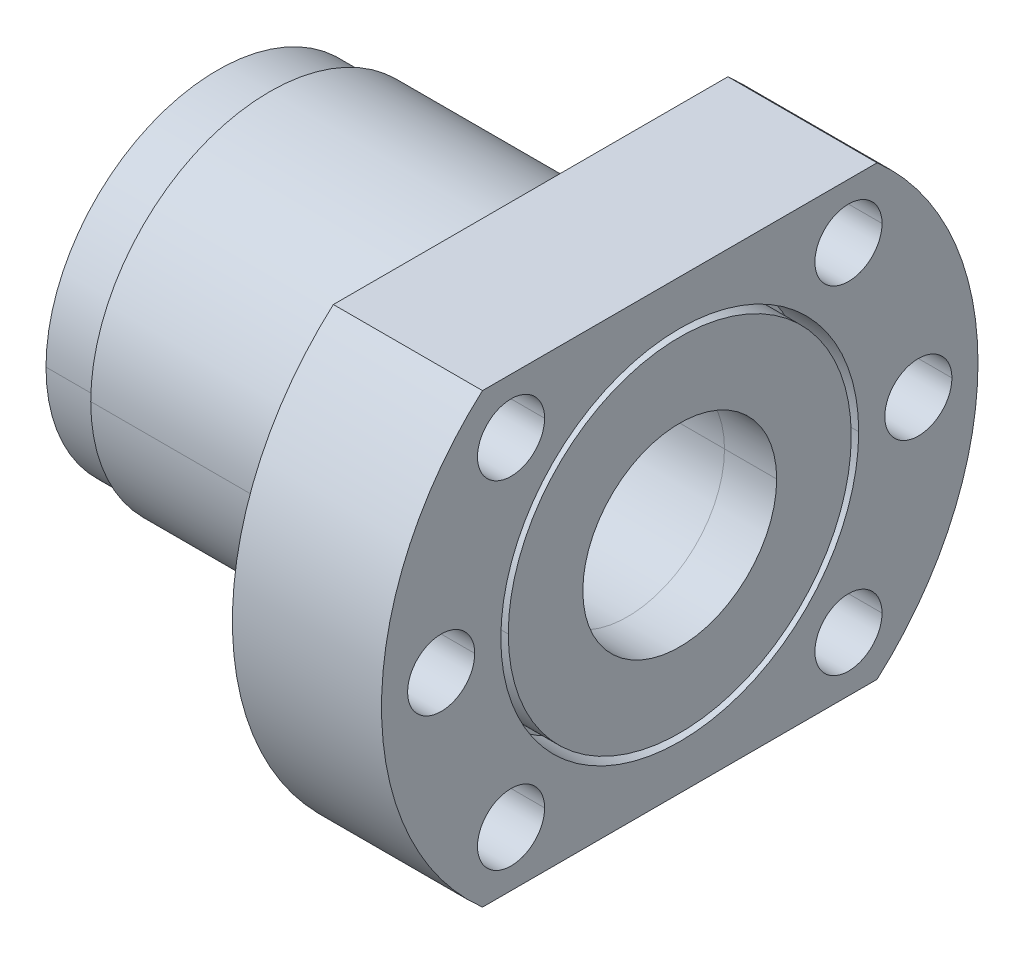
ISO-10303-21;
HEADER;
FILE_DESCRIPTION(('STEP AP214'),'2;1');
FILE_NAME('part.step','',(''),(''),'','','');
FILE_SCHEMA(('AUTOMOTIVE_DESIGN { 1 0 10303 214 1 1 1 1 }'));
ENDSEC;
DATA;
#1=APPLICATION_CONTEXT('core data for automotive mechanical design processes');
#2=APPLICATION_PROTOCOL_DEFINITION('international standard','automotive_design',2000,#1);
#3=PRODUCT_CONTEXT('',#1,'mechanical');
#4=PRODUCT('Part','Part','',(#3));
#5=PRODUCT_RELATED_PRODUCT_CATEGORY('part','',(#4));
#6=PRODUCT_DEFINITION_FORMATION('','',#4);
#7=PRODUCT_DEFINITION_CONTEXT('part definition',#1,'design');
#8=PRODUCT_DEFINITION('design','',#6,#7);
#9=PRODUCT_DEFINITION_SHAPE('','',#8);
#10=(LENGTH_UNIT() NAMED_UNIT(*) SI_UNIT(.MILLI.,.METRE.));
#11=(NAMED_UNIT(*) PLANE_ANGLE_UNIT() SI_UNIT($,.RADIAN.));
#12=(NAMED_UNIT(*) SI_UNIT($,.STERADIAN.) SOLID_ANGLE_UNIT());
#13=UNCERTAINTY_MEASURE_WITH_UNIT(LENGTH_MEASURE(1.E-05),#10,'distance_accuracy_value','');
#14=(GEOMETRIC_REPRESENTATION_CONTEXT(3) GLOBAL_UNCERTAINTY_ASSIGNED_CONTEXT((#13)) GLOBAL_UNIT_ASSIGNED_CONTEXT((#10,
#11,#12)) REPRESENTATION_CONTEXT('',''));
#15=CARTESIAN_POINT('',(0.,0.,0.));
#16=DIRECTION('',(0.,0.,1.));
#17=DIRECTION('',(1.,0.,0.));
#18=AXIS2_PLACEMENT_3D('',#15,#16,#17);
#19=CARTESIAN_POINT('',(-32.5,0.,0.));
#20=DIRECTION('',(1.,0.,0.));
#21=DIRECTION('',(0.,0.,-1.));
#22=AXIS2_PLACEMENT_3D('',#19,#20,#21);
#23=CYLINDRICAL_SURFACE('',#22,6.5);
#24=CARTESIAN_POINT('',(-18.,0.,0.));
#25=DIRECTION('',(1.,0.,0.));
#26=DIRECTION('',(0.,0.,-1.));
#27=AXIS2_PLACEMENT_3D('',#24,#25,#26);
#28=CIRCLE('',#27,6.5);
#29=CARTESIAN_POINT('',(-18.,0.,6.5));
#30=VERTEX_POINT('',#29);
#31=CARTESIAN_POINT('',(-18.,0.,-6.5));
#32=VERTEX_POINT('',#31);
#33=EDGE_CURVE('P0_E102',#30,#32,#28,.T.);
#34=ORIENTED_EDGE('',*,*,#33,.F.);
#35=DIRECTION('',(1.,0.,0.));
#36=VECTOR('',#35,1.);
#37=CARTESIAN_POINT('',(-32.5,0.,6.5));
#38=LINE('',#37,#36);
#39=CARTESIAN_POINT('',(-14.5000000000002,0.,6.5));
#40=VERTEX_POINT('',#39);
#41=EDGE_CURVE('P0_E113',#30,#40,#38,.T.);
#42=ORIENTED_EDGE('',*,*,#41,.T.);
#43=CARTESIAN_POINT('',(-14.5000000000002,0.,0.));
#44=DIRECTION('',(1.,0.,0.));
#45=DIRECTION('',(0.,0.,-1.));
#46=AXIS2_PLACEMENT_3D('',#43,#44,#45);
#47=CIRCLE('',#46,6.5);
#48=CARTESIAN_POINT('',(-14.5000000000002,0.,-6.5));
#49=VERTEX_POINT('',#48);
#50=EDGE_CURVE('P0_E11',#40,#49,#47,.T.);
#51=ORIENTED_EDGE('',*,*,#50,.T.);
#52=DIRECTION('',(1.,0.,0.));
#53=VECTOR('',#52,1.);
#54=CARTESIAN_POINT('',(-32.5,0.,-6.5));
#55=LINE('',#54,#53);
#56=EDGE_CURVE('P0_E109',#32,#49,#55,.T.);
#57=ORIENTED_EDGE('',*,*,#56,.F.);
#58=EDGE_LOOP('',(#34,#42,#51,#57));
#59=FACE_BOUND('',#58,.T.);
#60=ADVANCED_FACE('P0_F17',(#59),#23,.F.);
#61=CARTESIAN_POINT('',(-32.5,0.,0.));
#62=DIRECTION('',(1.,0.,0.));
#63=DIRECTION('',(0.,0.,-1.));
#64=AXIS2_PLACEMENT_3D('',#61,#62,#63);
#65=CYLINDRICAL_SURFACE('',#64,11.5);
#66=CARTESIAN_POINT('',(-18.,0.,0.));
#67=DIRECTION('',(1.,0.,0.));
#68=DIRECTION('',(0.,0.,-1.));
#69=AXIS2_PLACEMENT_3D('',#66,#67,#68);
#70=CIRCLE('',#69,11.5);
#71=CARTESIAN_POINT('',(-18.,0.,-11.5));
#72=VERTEX_POINT('',#71);
#73=CARTESIAN_POINT('',(-18.,0.,11.5));
#74=VERTEX_POINT('',#73);
#75=EDGE_CURVE('P0_E78',#72,#74,#70,.T.);
#76=ORIENTED_EDGE('',*,*,#75,.T.);
#77=DIRECTION('',(1.,0.,0.));
#78=VECTOR('',#77,1.);
#79=CARTESIAN_POINT('',(-32.5,0.,11.5));
#80=LINE('',#79,#78);
#81=CARTESIAN_POINT('',(-14.5000000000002,0.,11.5));
#82=VERTEX_POINT('',#81);
#83=EDGE_CURVE('P0_E84',#74,#82,#80,.T.);
#84=ORIENTED_EDGE('',*,*,#83,.T.);
#85=CARTESIAN_POINT('',(-14.5000000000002,0.,0.));
#86=DIRECTION('',(-1.,0.,0.));
#87=DIRECTION('',(0.,0.,-1.));
#88=AXIS2_PLACEMENT_3D('',#85,#86,#87);
#89=CIRCLE('',#88,11.5);
#90=CARTESIAN_POINT('',(-14.5000000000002,0.,-11.5));
#91=VERTEX_POINT('',#90);
#92=EDGE_CURVE('P0_E26',#82,#91,#89,.T.);
#93=ORIENTED_EDGE('',*,*,#92,.T.);
#94=DIRECTION('',(1.,0.,0.));
#95=VECTOR('',#94,1.);
#96=CARTESIAN_POINT('',(-32.5,0.,-11.5));
#97=LINE('',#96,#95);
#98=EDGE_CURVE('P0_E73',#72,#91,#97,.T.);
#99=ORIENTED_EDGE('',*,*,#98,.F.);
#100=EDGE_LOOP('',(#76,#84,#93,#99));
#101=FACE_BOUND('',#100,.T.);
#102=ADVANCED_FACE('P0_F75',(#101),#65,.T.);
#103=CARTESIAN_POINT('',(-14.5000000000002,-12.144,-12.144));
#104=DIRECTION('',(-1.,0.,0.));
#105=DIRECTION('',(0.,0.,1.));
#106=AXIS2_PLACEMENT_3D('',#103,#104,#105);
#107=PLANE('',#106);
#108=CARTESIAN_POINT('',(-14.5000000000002,0.,0.));
#109=DIRECTION('',(1.,0.,0.));
#110=DIRECTION('',(0.,0.,-1.));
#111=AXIS2_PLACEMENT_3D('',#108,#109,#110);
#112=CIRCLE('',#111,6.5);
#113=EDGE_CURVE('P0_E20',#49,#40,#112,.T.);
#114=ORIENTED_EDGE('',*,*,#113,.F.);
#115=ORIENTED_EDGE('',*,*,#50,.F.);
#116=EDGE_LOOP('',(#114,#115));
#117=FACE_BOUND('',#116,.T.);
#118=CARTESIAN_POINT('',(-14.5000000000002,0.,0.));
#119=DIRECTION('',(-1.,0.,0.));
#120=DIRECTION('',(0.,0.,-1.));
#121=AXIS2_PLACEMENT_3D('',#118,#119,#120);
#122=CIRCLE('',#121,11.5);
#123=EDGE_CURVE('P0_E83',#91,#82,#122,.T.);
#124=ORIENTED_EDGE('',*,*,#123,.F.);
#125=ORIENTED_EDGE('',*,*,#92,.F.);
#126=EDGE_LOOP('',(#124,#125));
#127=FACE_BOUND('',#126,.T.);
#128=ADVANCED_FACE('P0_F140',(#117,#127),#107,.F.);
#129=CARTESIAN_POINT('',(-32.5,0.,0.));
#130=DIRECTION('',(1.,0.,0.));
#131=DIRECTION('',(0.,0.,-1.));
#132=AXIS2_PLACEMENT_3D('',#129,#130,#131);
#133=CYLINDRICAL_SURFACE('',#132,6.5);
#134=ORIENTED_EDGE('',*,*,#41,.F.);
#135=CARTESIAN_POINT('',(-18.,0.,0.));
#136=DIRECTION('',(1.,0.,0.));
#137=DIRECTION('',(0.,0.,-1.));
#138=AXIS2_PLACEMENT_3D('',#135,#136,#137);
#139=CIRCLE('',#138,6.5);
#140=EDGE_CURVE('P0_E91',#32,#30,#139,.T.);
#141=ORIENTED_EDGE('',*,*,#140,.F.);
#142=ORIENTED_EDGE('',*,*,#56,.T.);
#143=ORIENTED_EDGE('',*,*,#113,.T.);
#144=EDGE_LOOP('',(#134,#141,#142,#143));
#145=FACE_BOUND('',#144,.T.);
#146=ADVANCED_FACE('P0_F124',(#145),#133,.F.);
#147=CARTESIAN_POINT('',(-32.5,0.,0.));
#148=DIRECTION('',(1.,0.,0.));
#149=DIRECTION('',(0.,0.,-1.));
#150=AXIS2_PLACEMENT_3D('',#147,#148,#149);
#151=CYLINDRICAL_SURFACE('',#150,11.5);
#152=ORIENTED_EDGE('',*,*,#83,.F.);
#153=CARTESIAN_POINT('',(-18.,0.,0.));
#154=DIRECTION('',(1.,0.,0.));
#155=DIRECTION('',(0.,0.,-1.));
#156=AXIS2_PLACEMENT_3D('',#153,#154,#155);
#157=CIRCLE('',#156,11.5);
#158=EDGE_CURVE('P0_E87',#74,#72,#157,.T.);
#159=ORIENTED_EDGE('',*,*,#158,.T.);
#160=ORIENTED_EDGE('',*,*,#98,.T.);
#161=ORIENTED_EDGE('',*,*,#123,.T.);
#162=EDGE_LOOP('',(#152,#159,#160,#161));
#163=FACE_BOUND('',#162,.T.);
#164=ADVANCED_FACE('P0_F88',(#163),#151,.T.);
#165=CARTESIAN_POINT('',(-18.,9.,0.));
#166=DIRECTION('',(1.,0.,0.));
#167=DIRECTION('',(0.,1.,0.));
#168=AXIS2_PLACEMENT_3D('',#165,#166,#167);
#169=PLANE('',#168);
#170=ORIENTED_EDGE('',*,*,#140,.T.);
#171=ORIENTED_EDGE('',*,*,#33,.T.);
#172=EDGE_LOOP('',(#170,#171));
#173=FACE_BOUND('',#172,.T.);
#174=ORIENTED_EDGE('',*,*,#75,.F.);
#175=ORIENTED_EDGE('',*,*,#158,.F.);
#176=EDGE_LOOP('',(#174,#175));
#177=FACE_BOUND('',#176,.T.);
#178=ADVANCED_FACE('P0_F93',(#173,#177),#169,.F.);
#179=CLOSED_SHELL('',(#60,#102,#128,#146,#164,#178));
#180=MANIFOLD_SOLID_BREP('P0_B1',#179);
#181=CARTESIAN_POINT('',(4.54747350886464E-10,0.,0.));
#182=DIRECTION('',(-1.,0.,0.));
#183=DIRECTION('',(0.,0.,1.));
#184=AXIS2_PLACEMENT_3D('',#181,#182,#183);
#185=CYLINDRICAL_SURFACE('',#184,6.);
#186=DIRECTION('',(-1.,0.,0.));
#187=VECTOR('',#186,1.);
#188=CARTESIAN_POINT('',(4.54747350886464E-10,0.,-6.));
#189=LINE('',#188,#187);
#190=CARTESIAN_POINT('',(-24.,0.,-6.));
#191=VERTEX_POINT('',#190);
#192=CARTESIAN_POINT('',(-42.,0.,-6.));
#193=VERTEX_POINT('',#192);
#194=EDGE_CURVE('P1_E515',#191,#193,#189,.T.);
#195=ORIENTED_EDGE('',*,*,#194,.F.);
#196=CARTESIAN_POINT('',(-24.,0.,0.));
#197=DIRECTION('',(1.,0.,0.));
#198=DIRECTION('',(0.,1.,0.));
#199=AXIS2_PLACEMENT_3D('',#196,#197,#198);
#200=CIRCLE('',#199,6.);
#201=CARTESIAN_POINT('',(-24.,0.,6.));
#202=VERTEX_POINT('',#201);
#203=EDGE_CURVE('P1_E250',#191,#202,#200,.T.);
#204=ORIENTED_EDGE('',*,*,#203,.T.);
#205=DIRECTION('',(-1.,0.,0.));
#206=VECTOR('',#205,1.);
#207=CARTESIAN_POINT('',(4.54747350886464E-10,0.,6.));
#208=LINE('',#207,#206);
#209=CARTESIAN_POINT('',(-42.,0.,6.));
#210=VERTEX_POINT('',#209);
#211=EDGE_CURVE('P1_E527',#202,#210,#208,.T.);
#212=ORIENTED_EDGE('',*,*,#211,.T.);
#213=CARTESIAN_POINT('',(-42.,0.,0.));
#214=DIRECTION('',(1.,0.,0.));
#215=DIRECTION('',(0.,1.,0.));
#216=AXIS2_PLACEMENT_3D('',#213,#214,#215);
#217=CIRCLE('',#216,6.);
#218=EDGE_CURVE('P1_E222',#193,#210,#217,.T.);
#219=ORIENTED_EDGE('',*,*,#218,.F.);
#220=EDGE_LOOP('',(#195,#204,#212,#219));
#221=FACE_BOUND('',#220,.T.);
#222=ADVANCED_FACE('P1_F16',(#221),#185,.F.);
#223=CARTESIAN_POINT('',(-60.,0.,0.));
#224=DIRECTION('',(1.,0.,0.));
#225=DIRECTION('',(0.,0.,-1.));
#226=AXIS2_PLACEMENT_3D('',#223,#224,#225);
#227=CYLINDRICAL_SURFACE('',#226,20.);
#228=CARTESIAN_POINT('',(-24.5,0.,0.));
#229=DIRECTION('',(-1.,0.,0.));
#230=DIRECTION('',(0.,0.,-1.));
#231=AXIS2_PLACEMENT_3D('',#228,#229,#230);
#232=CIRCLE('',#231,20.);
#233=CARTESIAN_POINT('',(-24.5,0.,-20.));
#234=VERTEX_POINT('',#233);
#235=CARTESIAN_POINT('',(-24.5,-15.,-13.228756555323));
#236=VERTEX_POINT('',#235);
#237=EDGE_CURVE('P1_E474',#234,#236,#232,.T.);
#238=ORIENTED_EDGE('',*,*,#237,.F.);
#239=DIRECTION('',(1.,0.,0.));
#240=VECTOR('',#239,1.);
#241=CARTESIAN_POINT('',(-60.,0.,-20.));
#242=LINE('',#241,#240);
#243=CARTESIAN_POINT('',(-14.5,0.,-20.));
#244=VERTEX_POINT('',#243);
#245=EDGE_CURVE('P1_E462',#234,#244,#242,.T.);
#246=ORIENTED_EDGE('',*,*,#245,.T.);
#247=CARTESIAN_POINT('',(-14.5,0.,0.));
#248=DIRECTION('',(-1.,0.,0.));
#249=DIRECTION('',(0.,0.,-1.));
#250=AXIS2_PLACEMENT_3D('',#247,#248,#249);
#251=CIRCLE('',#250,20.);
#252=CARTESIAN_POINT('',(-14.5,-15.,-13.228756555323));
#253=VERTEX_POINT('',#252);
#254=EDGE_CURVE('P1_E313',#244,#253,#251,.T.);
#255=ORIENTED_EDGE('',*,*,#254,.T.);
#256=DIRECTION('',(-1.,0.,0.));
#257=VECTOR('',#256,1.);
#258=CARTESIAN_POINT('',(-60.,-15.,-13.228756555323));
#259=LINE('',#258,#257);
#260=EDGE_CURVE('P1_E450',#253,#236,#259,.T.);
#261=ORIENTED_EDGE('',*,*,#260,.T.);
#262=EDGE_LOOP('',(#238,#246,#255,#261));
#263=FACE_BOUND('',#262,.T.);
#264=ADVANCED_FACE('P1_F682',(#263),#227,.T.);
#265=CARTESIAN_POINT('',(-14.5,-11.3137,11.3137));
#266=DIRECTION('',(-1.,0.,0.));
#267=DIRECTION('',(0.,0.,1.));
#268=AXIS2_PLACEMENT_3D('',#265,#266,#267);
#269=CYLINDRICAL_SURFACE('',#268,2.25);
#270=CARTESIAN_POINT('',(-14.5,-11.3137,11.3137));
#271=DIRECTION('',(-1.,0.,0.));
#272=DIRECTION('',(0.,0.,1.));
#273=AXIS2_PLACEMENT_3D('',#270,#271,#272);
#274=CIRCLE('',#273,2.25);
#275=CARTESIAN_POINT('',(-14.5,-11.3137,9.0637));
#276=VERTEX_POINT('',#275);
#277=CARTESIAN_POINT('',(-14.5,-11.3137,13.5637));
#278=VERTEX_POINT('',#277);
#279=EDGE_CURVE('P1_E288',#276,#278,#274,.T.);
#280=ORIENTED_EDGE('',*,*,#279,.F.);
#281=DIRECTION('',(-1.,0.,0.));
#282=VECTOR('',#281,1.);
#283=CARTESIAN_POINT('',(-14.5,-11.3137,9.0637));
#284=LINE('',#283,#282);
#285=CARTESIAN_POINT('',(-24.5,-11.3137,9.0637));
#286=VERTEX_POINT('',#285);
#287=EDGE_CURVE('P1_E436',#276,#286,#284,.T.);
#288=ORIENTED_EDGE('',*,*,#287,.T.);
#289=CARTESIAN_POINT('',(-24.5,-11.3137,11.3137));
#290=DIRECTION('',(1.,0.,0.));
#291=DIRECTION('',(0.,0.,1.));
#292=AXIS2_PLACEMENT_3D('',#289,#290,#291);
#293=CIRCLE('',#292,2.25);
#294=CARTESIAN_POINT('',(-24.5,-11.3137,13.5637));
#295=VERTEX_POINT('',#294);
#296=EDGE_CURVE('P1_E463',#295,#286,#293,.T.);
#297=ORIENTED_EDGE('',*,*,#296,.F.);
#298=DIRECTION('',(-1.,0.,0.));
#299=VECTOR('',#298,1.);
#300=CARTESIAN_POINT('',(-14.5,-11.3137,13.5637));
#301=LINE('',#300,#299);
#302=EDGE_CURVE('P1_E441',#278,#295,#301,.T.);
#303=ORIENTED_EDGE('',*,*,#302,.F.);
#304=EDGE_LOOP('',(#280,#288,#297,#303));
#305=FACE_BOUND('',#304,.T.);
#306=ADVANCED_FACE('P1_F651',(#305),#269,.F.);
#307=CARTESIAN_POINT('',(-14.5,11.3137,11.3137));
#308=DIRECTION('',(-1.,0.,0.));
#309=DIRECTION('',(0.,0.,1.));
#310=AXIS2_PLACEMENT_3D('',#307,#308,#309);
#311=CYLINDRICAL_SURFACE('',#310,2.25);
#312=CARTESIAN_POINT('',(-14.5,11.3137,11.3137));
#313=DIRECTION('',(-1.,0.,0.));
#314=DIRECTION('',(0.,0.,1.));
#315=AXIS2_PLACEMENT_3D('',#312,#313,#314);
#316=CIRCLE('',#315,2.25);
#317=CARTESIAN_POINT('',(-14.5,11.3137,9.0637));
#318=VERTEX_POINT('',#317);
#319=CARTESIAN_POINT('',(-14.5,11.3137,13.5637));
#320=VERTEX_POINT('',#319);
#321=EDGE_CURVE('P1_E289',#318,#320,#316,.T.);
#322=ORIENTED_EDGE('',*,*,#321,.F.);
#323=DIRECTION('',(-1.,0.,0.));
#324=VECTOR('',#323,1.);
#325=CARTESIAN_POINT('',(-14.5,11.3137,9.0637));
#326=LINE('',#325,#324);
#327=CARTESIAN_POINT('',(-24.5,11.3137,9.0637));
#328=VERTEX_POINT('',#327);
#329=EDGE_CURVE('P1_E273',#318,#328,#326,.T.);
#330=ORIENTED_EDGE('',*,*,#329,.T.);
#331=CARTESIAN_POINT('',(-24.5,11.3137,11.3137));
#332=DIRECTION('',(1.,0.,0.));
#333=DIRECTION('',(0.,0.,1.));
#334=AXIS2_PLACEMENT_3D('',#331,#332,#333);
#335=CIRCLE('',#334,2.25);
#336=CARTESIAN_POINT('',(-24.5,11.3137,13.5637));
#337=VERTEX_POINT('',#336);
#338=EDGE_CURVE('P1_E467',#337,#328,#335,.T.);
#339=ORIENTED_EDGE('',*,*,#338,.F.);
#340=DIRECTION('',(-1.,0.,0.));
#341=VECTOR('',#340,1.);
#342=CARTESIAN_POINT('',(-14.5,11.3137,13.5637));
#343=LINE('',#342,#341);
#344=EDGE_CURVE('P1_E268',#320,#337,#343,.T.);
#345=ORIENTED_EDGE('',*,*,#344,.F.);
#346=EDGE_LOOP('',(#322,#330,#339,#345));
#347=FACE_BOUND('',#346,.T.);
#348=ADVANCED_FACE('P1_F713',(#347),#311,.F.);
#349=CARTESIAN_POINT('',(-14.5,-11.3137,-11.3137));
#350=DIRECTION('',(-1.,0.,0.));
#351=DIRECTION('',(0.,0.,1.));
#352=AXIS2_PLACEMENT_3D('',#349,#350,#351);
#353=CYLINDRICAL_SURFACE('',#352,2.25);
#354=CARTESIAN_POINT('',(-14.5,-11.3137,-11.3137));
#355=DIRECTION('',(-1.,0.,0.));
#356=DIRECTION('',(0.,0.,1.));
#357=AXIS2_PLACEMENT_3D('',#354,#355,#356);
#358=CIRCLE('',#357,2.25);
#359=CARTESIAN_POINT('',(-14.5,-11.3137,-13.5637));
#360=VERTEX_POINT('',#359);
#361=CARTESIAN_POINT('',(-14.5,-11.3137,-9.0637));
#362=VERTEX_POINT('',#361);
#363=EDGE_CURVE('P1_E334',#360,#362,#358,.T.);
#364=ORIENTED_EDGE('',*,*,#363,.F.);
#365=DIRECTION('',(-1.,0.,0.));
#366=VECTOR('',#365,1.);
#367=CARTESIAN_POINT('',(-14.5,-11.3137,-13.5637));
#368=LINE('',#367,#366);
#369=CARTESIAN_POINT('',(-24.5,-11.3137,-13.5637));
#370=VERTEX_POINT('',#369);
#371=EDGE_CURVE('P1_E278',#360,#370,#368,.T.);
#372=ORIENTED_EDGE('',*,*,#371,.T.);
#373=CARTESIAN_POINT('',(-24.5,-11.3137,-11.3137));
#374=DIRECTION('',(1.,0.,0.));
#375=DIRECTION('',(0.,0.,1.));
#376=AXIS2_PLACEMENT_3D('',#373,#374,#375);
#377=CIRCLE('',#376,2.25);
#378=CARTESIAN_POINT('',(-24.5,-11.3137,-9.0637));
#379=VERTEX_POINT('',#378);
#380=EDGE_CURVE('P1_E296',#379,#370,#377,.T.);
#381=ORIENTED_EDGE('',*,*,#380,.F.);
#382=DIRECTION('',(-1.,0.,0.));
#383=VECTOR('',#382,1.);
#384=CARTESIAN_POINT('',(-14.5,-11.3137,-9.0637));
#385=LINE('',#384,#383);
#386=EDGE_CURVE('P1_E419',#362,#379,#385,.T.);
#387=ORIENTED_EDGE('',*,*,#386,.F.);
#388=EDGE_LOOP('',(#364,#372,#381,#387));
#389=FACE_BOUND('',#388,.T.);
#390=ADVANCED_FACE('P1_F718',(#389),#353,.F.);
#391=CARTESIAN_POINT('',(-14.5,11.3137,-11.3137));
#392=DIRECTION('',(-1.,0.,0.));
#393=DIRECTION('',(0.,0.,1.));
#394=AXIS2_PLACEMENT_3D('',#391,#392,#393);
#395=CYLINDRICAL_SURFACE('',#394,2.25);
#396=CARTESIAN_POINT('',(-14.5,11.3137,-11.3137));
#397=DIRECTION('',(-1.,0.,0.));
#398=DIRECTION('',(0.,0.,1.));
#399=AXIS2_PLACEMENT_3D('',#396,#397,#398);
#400=CIRCLE('',#399,2.25);
#401=CARTESIAN_POINT('',(-14.5,11.3137,-13.5637));
#402=VERTEX_POINT('',#401);
#403=CARTESIAN_POINT('',(-14.5,11.3137,-9.0637));
#404=VERTEX_POINT('',#403);
#405=EDGE_CURVE('P1_E335',#402,#404,#400,.T.);
#406=ORIENTED_EDGE('',*,*,#405,.F.);
#407=DIRECTION('',(-1.,0.,0.));
#408=VECTOR('',#407,1.);
#409=CARTESIAN_POINT('',(-14.5,11.3137,-13.5637));
#410=LINE('',#409,#408);
#411=CARTESIAN_POINT('',(-24.5,11.3137,-13.5637));
#412=VERTEX_POINT('',#411);
#413=EDGE_CURVE('P1_E301',#402,#412,#410,.T.);
#414=ORIENTED_EDGE('',*,*,#413,.T.);
#415=CARTESIAN_POINT('',(-24.5,11.3137,-11.3137));
#416=DIRECTION('',(1.,0.,0.));
#417=DIRECTION('',(0.,0.,1.));
#418=AXIS2_PLACEMENT_3D('',#415,#416,#417);
#419=CIRCLE('',#418,2.25);
#420=CARTESIAN_POINT('',(-24.5,11.3137,-9.0637));
#421=VERTEX_POINT('',#420);
#422=EDGE_CURVE('P1_E244',#421,#412,#419,.T.);
#423=ORIENTED_EDGE('',*,*,#422,.F.);
#424=DIRECTION('',(-1.,0.,0.));
#425=VECTOR('',#424,1.);
#426=CARTESIAN_POINT('',(-14.5,11.3137,-9.0637));
#427=LINE('',#426,#425);
#428=EDGE_CURVE('P1_E279',#404,#421,#427,.T.);
#429=ORIENTED_EDGE('',*,*,#428,.F.);
#430=EDGE_LOOP('',(#406,#414,#423,#429));
#431=FACE_BOUND('',#430,.T.);
#432=ADVANCED_FACE('P1_F720',(#431),#395,.F.);
#433=CARTESIAN_POINT('',(-14.5,0.,16.));
#434=DIRECTION('',(-1.,0.,0.));
#435=DIRECTION('',(0.,0.,1.));
#436=AXIS2_PLACEMENT_3D('',#433,#434,#435);
#437=CYLINDRICAL_SURFACE('',#436,2.25);
#438=CARTESIAN_POINT('',(-14.5,0.,16.));
#439=DIRECTION('',(-1.,0.,0.));
#440=DIRECTION('',(0.,0.,1.));
#441=AXIS2_PLACEMENT_3D('',#438,#439,#440);
#442=CIRCLE('',#441,2.25);
#443=CARTESIAN_POINT('',(-14.5,0.,13.75));
#444=VERTEX_POINT('',#443);
#445=CARTESIAN_POINT('',(-14.5,0.,18.25));
#446=VERTEX_POINT('',#445);
#447=EDGE_CURVE('P1_E352',#444,#446,#442,.T.);
#448=ORIENTED_EDGE('',*,*,#447,.F.);
#449=DIRECTION('',(-1.,0.,0.));
#450=VECTOR('',#449,1.);
#451=CARTESIAN_POINT('',(-14.5,0.,13.75));
#452=LINE('',#451,#450);
#453=CARTESIAN_POINT('',(-24.5,0.,13.75));
#454=VERTEX_POINT('',#453);
#455=EDGE_CURVE('P1_E402',#444,#454,#452,.T.);
#456=ORIENTED_EDGE('',*,*,#455,.T.);
#457=CARTESIAN_POINT('',(-24.5,0.,16.));
#458=DIRECTION('',(1.,0.,0.));
#459=DIRECTION('',(0.,0.,1.));
#460=AXIS2_PLACEMENT_3D('',#457,#458,#459);
#461=CIRCLE('',#460,2.25);
#462=CARTESIAN_POINT('',(-24.5,0.,18.25));
#463=VERTEX_POINT('',#462);
#464=EDGE_CURVE('P1_E241',#463,#454,#461,.T.);
#465=ORIENTED_EDGE('',*,*,#464,.F.);
#466=DIRECTION('',(-1.,0.,0.));
#467=VECTOR('',#466,1.);
#468=CARTESIAN_POINT('',(-14.5,0.,18.25));
#469=LINE('',#468,#467);
#470=EDGE_CURVE('P1_E406',#446,#463,#469,.T.);
#471=ORIENTED_EDGE('',*,*,#470,.F.);
#472=EDGE_LOOP('',(#448,#456,#465,#471));
#473=FACE_BOUND('',#472,.T.);
#474=ADVANCED_FACE('P1_F723',(#473),#437,.F.);
#475=CARTESIAN_POINT('',(-14.5,0.,-16.));
#476=DIRECTION('',(-1.,0.,0.));
#477=DIRECTION('',(0.,0.,1.));
#478=AXIS2_PLACEMENT_3D('',#475,#476,#477);
#479=CYLINDRICAL_SURFACE('',#478,2.25);
#480=CARTESIAN_POINT('',(-14.5,0.,-16.));
#481=DIRECTION('',(-1.,0.,0.));
#482=DIRECTION('',(0.,0.,1.));
#483=AXIS2_PLACEMENT_3D('',#480,#481,#482);
#484=CIRCLE('',#483,2.25);
#485=CARTESIAN_POINT('',(-14.5,0.,-18.25));
#486=VERTEX_POINT('',#485);
#487=CARTESIAN_POINT('',(-14.5,0.,-13.75));
#488=VERTEX_POINT('',#487);
#489=EDGE_CURVE('P1_E339',#486,#488,#484,.T.);
#490=ORIENTED_EDGE('',*,*,#489,.F.);
#491=DIRECTION('',(-1.,0.,0.));
#492=VECTOR('',#491,1.);
#493=CARTESIAN_POINT('',(-14.5,0.,-18.25));
#494=LINE('',#493,#492);
#495=CARTESIAN_POINT('',(-24.5,0.,-18.25));
#496=VERTEX_POINT('',#495);
#497=EDGE_CURVE('P1_E384',#486,#496,#494,.T.);
#498=ORIENTED_EDGE('',*,*,#497,.T.);
#499=CARTESIAN_POINT('',(-24.5,0.,-16.));
#500=DIRECTION('',(1.,0.,0.));
#501=DIRECTION('',(0.,0.,1.));
#502=AXIS2_PLACEMENT_3D('',#499,#500,#501);
#503=CIRCLE('',#502,2.25);
#504=CARTESIAN_POINT('',(-24.5,0.,-13.75));
#505=VERTEX_POINT('',#504);
#506=EDGE_CURVE('P1_E245',#505,#496,#503,.T.);
#507=ORIENTED_EDGE('',*,*,#506,.F.);
#508=DIRECTION('',(-1.,0.,0.));
#509=VECTOR('',#508,1.);
#510=CARTESIAN_POINT('',(-14.5,0.,-13.75));
#511=LINE('',#510,#509);
#512=EDGE_CURVE('P1_E387',#488,#505,#511,.T.);
#513=ORIENTED_EDGE('',*,*,#512,.F.);
#514=EDGE_LOOP('',(#490,#498,#507,#513));
#515=FACE_BOUND('',#514,.T.);
#516=ADVANCED_FACE('P1_F727',(#515),#479,.F.);
#517=CARTESIAN_POINT('',(-60.,0.,0.));
#518=DIRECTION('',(1.,0.,0.));
#519=DIRECTION('',(0.,0.,-1.));
#520=AXIS2_PLACEMENT_3D('',#517,#518,#519);
#521=CYLINDRICAL_SURFACE('',#520,6.5);
#522=CARTESIAN_POINT('',(-24.,0.,0.));
#523=DIRECTION('',(1.,0.,0.));
#524=DIRECTION('',(0.,1.,0.));
#525=AXIS2_PLACEMENT_3D('',#522,#523,#524);
#526=CIRCLE('',#525,6.5);
#527=CARTESIAN_POINT('',(-24.,0.,6.5));
#528=VERTEX_POINT('',#527);
#529=CARTESIAN_POINT('',(-24.,0.,-6.5));
#530=VERTEX_POINT('',#529);
#531=EDGE_CURVE('P1_E249',#528,#530,#526,.T.);
#532=ORIENTED_EDGE('',*,*,#531,.F.);
#533=DIRECTION('',(1.,0.,0.));
#534=VECTOR('',#533,1.);
#535=CARTESIAN_POINT('',(-60.,0.,6.5));
#536=LINE('',#535,#534);
#537=CARTESIAN_POINT('',(-18.,0.,6.5));
#538=VERTEX_POINT('',#537);
#539=EDGE_CURVE('P1_E376',#528,#538,#536,.T.);
#540=ORIENTED_EDGE('',*,*,#539,.T.);
#541=CARTESIAN_POINT('',(-18.,0.,0.));
#542=DIRECTION('',(-1.,0.,0.));
#543=DIRECTION('',(0.,0.,-1.));
#544=AXIS2_PLACEMENT_3D('',#541,#542,#543);
#545=CIRCLE('',#544,6.5);
#546=CARTESIAN_POINT('',(-18.,0.,-6.5));
#547=VERTEX_POINT('',#546);
#548=EDGE_CURVE('P1_E283',#547,#538,#545,.T.);
#549=ORIENTED_EDGE('',*,*,#548,.F.);
#550=DIRECTION('',(1.,0.,0.));
#551=VECTOR('',#550,1.);
#552=CARTESIAN_POINT('',(-60.,0.,-6.5));
#553=LINE('',#552,#551);
#554=EDGE_CURVE('P1_E380',#530,#547,#553,.T.);
#555=ORIENTED_EDGE('',*,*,#554,.F.);
#556=EDGE_LOOP('',(#532,#540,#549,#555));
#557=FACE_BOUND('',#556,.T.);
#558=ADVANCED_FACE('P1_F734',(#557),#521,.F.);
#559=CARTESIAN_POINT('',(-60.,0.,0.));
#560=DIRECTION('',(1.,0.,0.));
#561=DIRECTION('',(0.,0.,-1.));
#562=AXIS2_PLACEMENT_3D('',#559,#560,#561);
#563=CYLINDRICAL_SURFACE('',#562,12.);
#564=CARTESIAN_POINT('',(-18.,0.,0.));
#565=DIRECTION('',(-1.,0.,0.));
#566=DIRECTION('',(0.,0.,-1.));
#567=AXIS2_PLACEMENT_3D('',#564,#565,#566);
#568=CIRCLE('',#567,12.);
#569=CARTESIAN_POINT('',(-18.,0.,-12.));
#570=VERTEX_POINT('',#569);
#571=CARTESIAN_POINT('',(-18.,0.,12.));
#572=VERTEX_POINT('',#571);
#573=EDGE_CURVE('P1_E267',#570,#572,#568,.T.);
#574=ORIENTED_EDGE('',*,*,#573,.T.);
#575=DIRECTION('',(1.,0.,0.));
#576=VECTOR('',#575,1.);
#577=CARTESIAN_POINT('',(-60.,0.,12.));
#578=LINE('',#577,#576);
#579=CARTESIAN_POINT('',(-14.5,0.,12.));
#580=VERTEX_POINT('',#579);
#581=EDGE_CURVE('P1_E254',#572,#580,#578,.T.);
#582=ORIENTED_EDGE('',*,*,#581,.T.);
#583=CARTESIAN_POINT('',(-14.5,0.,0.));
#584=DIRECTION('',(1.,0.,0.));
#585=DIRECTION('',(0.,0.,-1.));
#586=AXIS2_PLACEMENT_3D('',#583,#584,#585);
#587=CIRCLE('',#586,12.);
#588=CARTESIAN_POINT('',(-14.5,0.,-12.));
#589=VERTEX_POINT('',#588);
#590=EDGE_CURVE('P1_E329',#580,#589,#587,.T.);
#591=ORIENTED_EDGE('',*,*,#590,.T.);
#592=DIRECTION('',(1.,0.,0.));
#593=VECTOR('',#592,1.);
#594=CARTESIAN_POINT('',(-60.,0.,-12.));
#595=LINE('',#594,#593);
#596=EDGE_CURVE('P1_E259',#570,#589,#595,.T.);
#597=ORIENTED_EDGE('',*,*,#596,.F.);
#598=EDGE_LOOP('',(#574,#582,#591,#597));
#599=FACE_BOUND('',#598,.T.);
#600=ADVANCED_FACE('P1_F738',(#599),#563,.F.);
#601=CARTESIAN_POINT('',(-60.,0.,0.));
#602=DIRECTION('',(1.,0.,0.));
#603=DIRECTION('',(0.,0.,-1.));
#604=AXIS2_PLACEMENT_3D('',#601,#602,#603);
#605=CYLINDRICAL_SURFACE('',#604,6.5);
#606=CARTESIAN_POINT('',(-45.5,0.,0.));
#607=DIRECTION('',(1.,0.,0.));
#608=DIRECTION('',(0.,0.,-1.));
#609=AXIS2_PLACEMENT_3D('',#606,#607,#608);
#610=CIRCLE('',#609,6.5);
#611=CARTESIAN_POINT('',(-45.5,0.,6.5));
#612=VERTEX_POINT('',#611);
#613=CARTESIAN_POINT('',(-45.5,0.,-6.5));
#614=VERTEX_POINT('',#613);
#615=EDGE_CURVE('P1_E212',#612,#614,#610,.T.);
#616=ORIENTED_EDGE('',*,*,#615,.F.);
#617=DIRECTION('',(1.,0.,0.));
#618=VECTOR('',#617,1.);
#619=CARTESIAN_POINT('',(-60.,0.,6.5));
#620=LINE('',#619,#618);
#621=CARTESIAN_POINT('',(-42.,0.,6.5));
#622=VERTEX_POINT('',#621);
#623=EDGE_CURVE('P1_E25',#612,#622,#620,.T.);
#624=ORIENTED_EDGE('',*,*,#623,.T.);
#625=CARTESIAN_POINT('',(-42.,0.,0.));
#626=DIRECTION('',(-1.,0.,0.));
#627=DIRECTION('',(0.,1.,0.));
#628=AXIS2_PLACEMENT_3D('',#625,#626,#627);
#629=CIRCLE('',#628,6.5);
#630=CARTESIAN_POINT('',(-42.,0.,-6.5));
#631=VERTEX_POINT('',#630);
#632=EDGE_CURVE('P1_E495',#631,#622,#629,.T.);
#633=ORIENTED_EDGE('',*,*,#632,.F.);
#634=DIRECTION('',(1.,0.,0.));
#635=VECTOR('',#634,1.);
#636=CARTESIAN_POINT('',(-60.,0.,-6.5));
#637=LINE('',#636,#635);
#638=EDGE_CURVE('P1_E10',#614,#631,#637,.T.);
#639=ORIENTED_EDGE('',*,*,#638,.F.);
#640=EDGE_LOOP('',(#616,#624,#633,#639));
#641=FACE_BOUND('',#640,.T.);
#642=ADVANCED_FACE('P1_F506',(#641),#605,.F.);
#643=CARTESIAN_POINT('',(-60.,0.,0.));
#644=DIRECTION('',(1.,0.,0.));
#645=DIRECTION('',(0.,0.,-1.));
#646=AXIS2_PLACEMENT_3D('',#643,#644,#645);
#647=CYLINDRICAL_SURFACE('',#646,11.5);
#648=CARTESIAN_POINT('',(-45.5,0.,0.));
#649=DIRECTION('',(1.,0.,0.));
#650=DIRECTION('',(0.,0.,-1.));
#651=AXIS2_PLACEMENT_3D('',#648,#649,#650);
#652=CIRCLE('',#651,11.5);
#653=CARTESIAN_POINT('',(-45.5,0.,-11.5));
#654=VERTEX_POINT('',#653);
#655=CARTESIAN_POINT('',(-45.5,0.,11.5));
#656=VERTEX_POINT('',#655);
#657=EDGE_CURVE('P1_E216',#654,#656,#652,.T.);
#658=ORIENTED_EDGE('',*,*,#657,.T.);
#659=DIRECTION('',(1.,0.,0.));
#660=VECTOR('',#659,1.);
#661=CARTESIAN_POINT('',(-60.,0.,11.5));
#662=LINE('',#661,#660);
#663=CARTESIAN_POINT('',(-42.,0.,11.5));
#664=VERTEX_POINT('',#663);
#665=EDGE_CURVE('P1_E203',#656,#664,#662,.T.);
#666=ORIENTED_EDGE('',*,*,#665,.T.);
#667=CARTESIAN_POINT('',(-42.,0.,0.));
#668=DIRECTION('',(-1.,0.,0.));
#669=DIRECTION('',(0.,1.,0.));
#670=AXIS2_PLACEMENT_3D('',#667,#668,#669);
#671=CIRCLE('',#670,11.5);
#672=CARTESIAN_POINT('',(-42.,0.,-11.5));
#673=VERTEX_POINT('',#672);
#674=EDGE_CURVE('P1_E492',#664,#673,#671,.T.);
#675=ORIENTED_EDGE('',*,*,#674,.T.);
#676=DIRECTION('',(1.,0.,0.));
#677=VECTOR('',#676,1.);
#678=CARTESIAN_POINT('',(-60.,0.,-11.5));
#679=LINE('',#678,#677);
#680=EDGE_CURVE('P1_E195',#654,#673,#679,.T.);
#681=ORIENTED_EDGE('',*,*,#680,.F.);
#682=EDGE_LOOP('',(#658,#666,#675,#681));
#683=FACE_BOUND('',#682,.T.);
#684=ADVANCED_FACE('P1_F220',(#683),#647,.T.);
#685=CARTESIAN_POINT('',(-42.,0.,0.));
#686=DIRECTION('',(1.,0.,0.));
#687=DIRECTION('',(0.,0.,-1.));
#688=AXIS2_PLACEMENT_3D('',#685,#686,#687);
#689=CYLINDRICAL_SURFACE('',#688,12.);
#690=DIRECTION('',(1.,0.,0.));
#691=VECTOR('',#690,1.);
#692=CARTESIAN_POINT('',(-42.,0.,12.));
#693=LINE('',#692,#691);
#694=CARTESIAN_POINT('',(-42.,0.,12.));
#695=VERTEX_POINT('',#694);
#696=CARTESIAN_POINT('',(-24.5,0.,12.));
#697=VERTEX_POINT('',#696);
#698=EDGE_CURVE('P1_E233',#695,#697,#693,.T.);
#699=ORIENTED_EDGE('',*,*,#698,.F.);
#700=CARTESIAN_POINT('',(-42.,0.,0.));
#701=DIRECTION('',(1.,0.,0.));
#702=DIRECTION('',(0.,0.,-1.));
#703=AXIS2_PLACEMENT_3D('',#700,#701,#702);
#704=CIRCLE('',#703,12.);
#705=CARTESIAN_POINT('',(-42.,0.,-12.));
#706=VERTEX_POINT('',#705);
#707=EDGE_CURVE('P1_E486',#695,#706,#704,.T.);
#708=ORIENTED_EDGE('',*,*,#707,.T.);
#709=DIRECTION('',(1.,0.,0.));
#710=VECTOR('',#709,1.);
#711=CARTESIAN_POINT('',(-42.,0.,-12.));
#712=LINE('',#711,#710);
#713=CARTESIAN_POINT('',(-24.5,0.,-12.));
#714=VERTEX_POINT('',#713);
#715=EDGE_CURVE('P1_E235',#706,#714,#712,.T.);
#716=ORIENTED_EDGE('',*,*,#715,.T.);
#717=CARTESIAN_POINT('',(-24.5,0.,0.));
#718=DIRECTION('',(1.,0.,0.));
#719=DIRECTION('',(0.,0.,1.));
#720=AXIS2_PLACEMENT_3D('',#717,#718,#719);
#721=CIRCLE('',#720,12.);
#722=EDGE_CURVE('P1_E466',#697,#714,#721,.T.);
#723=ORIENTED_EDGE('',*,*,#722,.F.);
#724=EDGE_LOOP('',(#699,#708,#716,#723));
#725=FACE_BOUND('',#724,.T.);
#726=ADVANCED_FACE('P1_F746',(#725),#689,.T.);
#727=CARTESIAN_POINT('',(-60.,0.,0.));
#728=DIRECTION('',(1.,0.,0.));
#729=DIRECTION('',(0.,0.,-1.));
#730=AXIS2_PLACEMENT_3D('',#727,#728,#729);
#731=CYLINDRICAL_SURFACE('',#730,6.5);
#732=ORIENTED_EDGE('',*,*,#623,.F.);
#733=CARTESIAN_POINT('',(-45.5,0.,0.));
#734=DIRECTION('',(1.,0.,0.));
#735=DIRECTION('',(0.,0.,-1.));
#736=AXIS2_PLACEMENT_3D('',#733,#734,#735);
#737=CIRCLE('',#736,6.5);
#738=EDGE_CURVE('P1_E218',#614,#612,#737,.T.);
#739=ORIENTED_EDGE('',*,*,#738,.F.);
#740=ORIENTED_EDGE('',*,*,#638,.T.);
#741=CARTESIAN_POINT('',(-42.,0.,0.));
#742=DIRECTION('',(-1.,0.,0.));
#743=DIRECTION('',(0.,1.,0.));
#744=AXIS2_PLACEMENT_3D('',#741,#742,#743);
#745=CIRCLE('',#744,6.5);
#746=EDGE_CURVE('P1_E229',#622,#631,#745,.T.);
#747=ORIENTED_EDGE('',*,*,#746,.F.);
#748=EDGE_LOOP('',(#732,#739,#740,#747));
#749=FACE_BOUND('',#748,.T.);
#750=ADVANCED_FACE('P1_F749',(#749),#731,.F.);
#751=CARTESIAN_POINT('',(-60.,0.,0.));
#752=DIRECTION('',(1.,0.,0.));
#753=DIRECTION('',(0.,0.,-1.));
#754=AXIS2_PLACEMENT_3D('',#751,#752,#753);
#755=CYLINDRICAL_SURFACE('',#754,11.5);
#756=ORIENTED_EDGE('',*,*,#665,.F.);
#757=CARTESIAN_POINT('',(-45.5,0.,0.));
#758=DIRECTION('',(1.,0.,0.));
#759=DIRECTION('',(0.,0.,-1.));
#760=AXIS2_PLACEMENT_3D('',#757,#758,#759);
#761=CIRCLE('',#760,11.5);
#762=EDGE_CURVE('P1_E206',#656,#654,#761,.T.);
#763=ORIENTED_EDGE('',*,*,#762,.T.);
#764=ORIENTED_EDGE('',*,*,#680,.T.);
#765=CARTESIAN_POINT('',(-42.,0.,0.));
#766=DIRECTION('',(-1.,0.,0.));
#767=DIRECTION('',(0.,1.,0.));
#768=AXIS2_PLACEMENT_3D('',#765,#766,#767);
#769=CIRCLE('',#768,11.5);
#770=EDGE_CURVE('P1_E209',#673,#664,#769,.T.);
#771=ORIENTED_EDGE('',*,*,#770,.T.);
#772=EDGE_LOOP('',(#756,#763,#764,#771));
#773=FACE_BOUND('',#772,.T.);
#774=ADVANCED_FACE('P1_F205',(#773),#755,.T.);
#775=CARTESIAN_POINT('',(-45.5,9.,0.));
#776=DIRECTION('',(1.,0.,0.));
#777=DIRECTION('',(0.,1.,0.));
#778=AXIS2_PLACEMENT_3D('',#775,#776,#777);
#779=PLANE('',#778);
#780=ORIENTED_EDGE('',*,*,#738,.T.);
#781=ORIENTED_EDGE('',*,*,#615,.T.);
#782=EDGE_LOOP('',(#780,#781));
#783=FACE_BOUND('',#782,.T.);
#784=ORIENTED_EDGE('',*,*,#657,.F.);
#785=ORIENTED_EDGE('',*,*,#762,.F.);
#786=EDGE_LOOP('',(#784,#785));
#787=FACE_BOUND('',#786,.T.);
#788=ADVANCED_FACE('P1_F215',(#783,#787),#779,.F.);
#789=CARTESIAN_POINT('',(-42.,0.,0.));
#790=DIRECTION('',(1.,0.,0.));
#791=DIRECTION('',(0.,-1.,0.));
#792=AXIS2_PLACEMENT_3D('',#789,#790,#791);
#793=PLANE('',#792);
#794=CARTESIAN_POINT('',(-42.,0.,0.));
#795=DIRECTION('',(1.,0.,0.));
#796=DIRECTION('',(0.,1.,0.));
#797=AXIS2_PLACEMENT_3D('',#794,#795,#796);
#798=CIRCLE('',#797,6.);
#799=EDGE_CURVE('P1_E519',#210,#193,#798,.T.);
#800=ORIENTED_EDGE('',*,*,#799,.T.);
#801=ORIENTED_EDGE('',*,*,#218,.T.);
#802=EDGE_LOOP('',(#800,#801));
#803=FACE_BOUND('',#802,.T.);
#804=ORIENTED_EDGE('',*,*,#632,.T.);
#805=ORIENTED_EDGE('',*,*,#746,.T.);
#806=EDGE_LOOP('',(#804,#805));
#807=FACE_BOUND('',#806,.T.);
#808=ADVANCED_FACE('P1_F504',(#803,#807),#793,.F.);
#809=CARTESIAN_POINT('',(-42.,0.,0.));
#810=DIRECTION('',(1.,0.,0.));
#811=DIRECTION('',(0.,-1.,0.));
#812=AXIS2_PLACEMENT_3D('',#809,#810,#811);
#813=PLANE('',#812);
#814=ORIENTED_EDGE('',*,*,#770,.F.);
#815=ORIENTED_EDGE('',*,*,#674,.F.);
#816=EDGE_LOOP('',(#814,#815));
#817=FACE_BOUND('',#816,.T.);
#818=CARTESIAN_POINT('',(-42.,0.,0.));
#819=DIRECTION('',(1.,0.,0.));
#820=DIRECTION('',(0.,0.,-1.));
#821=AXIS2_PLACEMENT_3D('',#818,#819,#820);
#822=CIRCLE('',#821,12.);
#823=EDGE_CURVE('P1_E512',#706,#695,#822,.T.);
#824=ORIENTED_EDGE('',*,*,#823,.F.);
#825=ORIENTED_EDGE('',*,*,#707,.F.);
#826=EDGE_LOOP('',(#824,#825));
#827=FACE_BOUND('',#826,.T.);
#828=ADVANCED_FACE('P1_F692',(#817,#827),#813,.F.);
#829=CARTESIAN_POINT('',(-24.5,16.,0.));
#830=DIRECTION('',(-1.,0.,0.));
#831=DIRECTION('',(0.,0.,1.));
#832=AXIS2_PLACEMENT_3D('',#829,#830,#831);
#833=PLANE('',#832);
#834=CARTESIAN_POINT('',(-24.5,0.,0.));
#835=DIRECTION('',(1.,0.,0.));
#836=DIRECTION('',(0.,0.,1.));
#837=AXIS2_PLACEMENT_3D('',#834,#835,#836);
#838=CIRCLE('',#837,12.);
#839=EDGE_CURVE('P1_E240',#714,#697,#838,.T.);
#840=ORIENTED_EDGE('',*,*,#839,.T.);
#841=ORIENTED_EDGE('',*,*,#722,.T.);
#842=EDGE_LOOP('',(#840,#841));
#843=FACE_BOUND('',#842,.T.);
#844=ORIENTED_EDGE('',*,*,#296,.T.);
#845=CARTESIAN_POINT('',(-24.5,-11.3137,11.3137));
#846=DIRECTION('',(1.,0.,0.));
#847=DIRECTION('',(0.,0.,1.));
#848=AXIS2_PLACEMENT_3D('',#845,#846,#847);
#849=CIRCLE('',#848,2.25);
#850=EDGE_CURVE('P1_E445',#286,#295,#849,.T.);
#851=ORIENTED_EDGE('',*,*,#850,.T.);
#852=EDGE_LOOP('',(#844,#851));
#853=FACE_BOUND('',#852,.T.);
#854=ORIENTED_EDGE('',*,*,#338,.T.);
#855=CARTESIAN_POINT('',(-24.5,11.3137,11.3137));
#856=DIRECTION('',(1.,0.,0.));
#857=DIRECTION('',(0.,0.,1.));
#858=AXIS2_PLACEMENT_3D('',#855,#856,#857);
#859=CIRCLE('',#858,2.25);
#860=EDGE_CURVE('P1_E272',#328,#337,#859,.T.);
#861=ORIENTED_EDGE('',*,*,#860,.T.);
#862=EDGE_LOOP('',(#854,#861));
#863=FACE_BOUND('',#862,.T.);
#864=ORIENTED_EDGE('',*,*,#380,.T.);
#865=CARTESIAN_POINT('',(-24.5,-11.3137,-11.3137));
#866=DIRECTION('',(1.,0.,0.));
#867=DIRECTION('',(0.,0.,1.));
#868=AXIS2_PLACEMENT_3D('',#865,#866,#867);
#869=CIRCLE('',#868,2.25);
#870=EDGE_CURVE('P1_E427',#370,#379,#869,.T.);
#871=ORIENTED_EDGE('',*,*,#870,.T.);
#872=EDGE_LOOP('',(#864,#871));
#873=FACE_BOUND('',#872,.T.);
#874=ORIENTED_EDGE('',*,*,#422,.T.);
#875=CARTESIAN_POINT('',(-24.5,11.3137,-11.3137));
#876=DIRECTION('',(1.,0.,0.));
#877=DIRECTION('',(0.,0.,1.));
#878=AXIS2_PLACEMENT_3D('',#875,#876,#877);
#879=CIRCLE('',#878,2.25);
#880=EDGE_CURVE('P1_E274',#412,#421,#879,.T.);
#881=ORIENTED_EDGE('',*,*,#880,.T.);
#882=EDGE_LOOP('',(#874,#881));
#883=FACE_BOUND('',#882,.T.);
#884=ORIENTED_EDGE('',*,*,#464,.T.);
#885=CARTESIAN_POINT('',(-24.5,0.,16.));
#886=DIRECTION('',(1.,0.,0.));
#887=DIRECTION('',(0.,0.,1.));
#888=AXIS2_PLACEMENT_3D('',#885,#886,#887);
#889=CIRCLE('',#888,2.25);
#890=EDGE_CURVE('P1_E305',#454,#463,#889,.T.);
#891=ORIENTED_EDGE('',*,*,#890,.T.);
#892=EDGE_LOOP('',(#884,#891));
#893=FACE_BOUND('',#892,.T.);
#894=ORIENTED_EDGE('',*,*,#506,.T.);
#895=CARTESIAN_POINT('',(-24.5,0.,-16.));
#896=DIRECTION('',(1.,0.,0.));
#897=DIRECTION('',(0.,0.,1.));
#898=AXIS2_PLACEMENT_3D('',#895,#896,#897);
#899=CIRCLE('',#898,2.25);
#900=EDGE_CURVE('P1_E392',#496,#505,#899,.T.);
#901=ORIENTED_EDGE('',*,*,#900,.T.);
#902=EDGE_LOOP('',(#894,#901));
#903=FACE_BOUND('',#902,.T.);
#904=DIRECTION('',(0.,0.,-1.));
#905=VECTOR('',#904,1.);
#906=CARTESIAN_POINT('',(-24.5,15.,0.));
#907=LINE('',#906,#905);
#908=CARTESIAN_POINT('',(-24.5,15.,13.228756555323));
#909=VERTEX_POINT('',#908);
#910=CARTESIAN_POINT('',(-24.5,15.,-13.228756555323));
#911=VERTEX_POINT('',#910);
#912=EDGE_CURVE('P1_E458',#909,#911,#907,.T.);
#913=ORIENTED_EDGE('',*,*,#912,.T.);
#914=CARTESIAN_POINT('',(-24.5,0.,0.));
#915=DIRECTION('',(-1.,0.,0.));
#916=DIRECTION('',(0.,0.,-1.));
#917=AXIS2_PLACEMENT_3D('',#914,#915,#916);
#918=CIRCLE('',#917,20.);
#919=EDGE_CURVE('P1_E470',#911,#234,#918,.T.);
#920=ORIENTED_EDGE('',*,*,#919,.T.);
#921=ORIENTED_EDGE('',*,*,#237,.T.);
#922=DIRECTION('',(0.,0.,1.));
#923=VECTOR('',#922,1.);
#924=CARTESIAN_POINT('',(-24.5,-15.,0.));
#925=LINE('',#924,#923);
#926=CARTESIAN_POINT('',(-24.5,-15.,13.228756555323));
#927=VERTEX_POINT('',#926);
#928=EDGE_CURVE('P1_E449',#236,#927,#925,.T.);
#929=ORIENTED_EDGE('',*,*,#928,.T.);
#930=CARTESIAN_POINT('',(-24.5,0.,0.));
#931=DIRECTION('',(-1.,0.,0.));
#932=DIRECTION('',(0.,0.,-1.));
#933=AXIS2_PLACEMENT_3D('',#930,#931,#932);
#934=CIRCLE('',#933,20.);
#935=EDGE_CURVE('P1_E393',#927,#909,#934,.T.);
#936=ORIENTED_EDGE('',*,*,#935,.T.);
#937=EDGE_LOOP('',(#913,#920,#921,#929,#936));
#938=FACE_BOUND('',#937,.T.);
#939=ADVANCED_FACE('P1_F690',(#843,#853,#863,#873,#883,#893,#903,#938),#833,.T.);
#940=CARTESIAN_POINT('',(-60.,0.,0.));
#941=DIRECTION('',(1.,0.,0.));
#942=DIRECTION('',(0.,0.,-1.));
#943=AXIS2_PLACEMENT_3D('',#940,#941,#942);
#944=CYLINDRICAL_SURFACE('',#943,20.);
#945=ORIENTED_EDGE('',*,*,#245,.F.);
#946=ORIENTED_EDGE('',*,*,#919,.F.);
#947=DIRECTION('',(1.,0.,0.));
#948=VECTOR('',#947,1.);
#949=CARTESIAN_POINT('',(-60.,15.,-13.228756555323));
#950=LINE('',#949,#948);
#951=CARTESIAN_POINT('',(-14.5,15.,-13.228756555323));
#952=VERTEX_POINT('',#951);
#953=EDGE_CURVE('P1_E397',#911,#952,#950,.T.);
#954=ORIENTED_EDGE('',*,*,#953,.T.);
#955=CARTESIAN_POINT('',(-14.5,0.,0.));
#956=DIRECTION('',(-1.,0.,0.));
#957=DIRECTION('',(0.,0.,-1.));
#958=AXIS2_PLACEMENT_3D('',#955,#956,#957);
#959=CIRCLE('',#958,20.);
#960=EDGE_CURVE('P1_E317',#952,#244,#959,.T.);
#961=ORIENTED_EDGE('',*,*,#960,.T.);
#962=EDGE_LOOP('',(#945,#946,#954,#961));
#963=FACE_BOUND('',#962,.T.);
#964=ADVANCED_FACE('P1_F685',(#963),#944,.T.);
#965=CARTESIAN_POINT('',(-14.5,15.,-29.4864473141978));
#966=DIRECTION('',(0.,-1.,0.));
#967=DIRECTION('',(-1.,0.,0.));
#968=AXIS2_PLACEMENT_3D('',#965,#966,#967);
#969=PLANE('',#968);
#970=DIRECTION('',(-1.,0.,0.));
#971=VECTOR('',#970,1.);
#972=CARTESIAN_POINT('',(-14.5,15.,13.228756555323));
#973=LINE('',#972,#971);
#974=CARTESIAN_POINT('',(-14.5,15.,13.228756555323));
#975=VERTEX_POINT('',#974);
#976=EDGE_CURVE('P1_E398',#975,#909,#973,.T.);
#977=ORIENTED_EDGE('',*,*,#976,.F.);
#978=DIRECTION('',(0.,0.,1.));
#979=VECTOR('',#978,1.);
#980=CARTESIAN_POINT('',(-14.5,15.,-29.4864473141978));
#981=LINE('',#980,#979);
#982=EDGE_CURVE('P1_E321',#952,#975,#981,.T.);
#983=ORIENTED_EDGE('',*,*,#982,.F.);
#984=ORIENTED_EDGE('',*,*,#953,.F.);
#985=ORIENTED_EDGE('',*,*,#912,.F.);
#986=EDGE_LOOP('',(#977,#983,#984,#985));
#987=FACE_BOUND('',#986,.T.);
#988=ADVANCED_FACE('P1_F688',(#987),#969,.F.);
#989=CARTESIAN_POINT('',(-60.,0.,0.));
#990=DIRECTION('',(1.,0.,0.));
#991=DIRECTION('',(0.,0.,-1.));
#992=AXIS2_PLACEMENT_3D('',#989,#990,#991);
#993=CYLINDRICAL_SURFACE('',#992,20.);
#994=CARTESIAN_POINT('',(-14.5,0.,0.));
#995=DIRECTION('',(-1.,0.,0.));
#996=DIRECTION('',(0.,0.,-1.));
#997=AXIS2_PLACEMENT_3D('',#994,#995,#996);
#998=CIRCLE('',#997,20.);
#999=CARTESIAN_POINT('',(-14.5,-15.,13.228756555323));
#1000=VERTEX_POINT('',#999);
#1001=EDGE_CURVE('P1_E300',#1000,#975,#998,.T.);
#1002=ORIENTED_EDGE('',*,*,#1001,.T.);
#1003=ORIENTED_EDGE('',*,*,#976,.T.);
#1004=ORIENTED_EDGE('',*,*,#935,.F.);
#1005=DIRECTION('',(1.,0.,0.));
#1006=VECTOR('',#1005,1.);
#1007=CARTESIAN_POINT('',(-60.,-15.,13.228756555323));
#1008=LINE('',#1007,#1006);
#1009=EDGE_CURVE('P1_E423',#927,#1000,#1008,.T.);
#1010=ORIENTED_EDGE('',*,*,#1009,.T.);
#1011=EDGE_LOOP('',(#1002,#1003,#1004,#1010));
#1012=FACE_BOUND('',#1011,.T.);
#1013=ADVANCED_FACE('P1_F675',(#1012),#993,.T.);
#1014=CARTESIAN_POINT('',(-14.5,-15.,-25.5203088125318));
#1015=DIRECTION('',(0.,-1.,0.));
#1016=DIRECTION('',(-1.,0.,0.));
#1017=AXIS2_PLACEMENT_3D('',#1014,#1015,#1016);
#1018=PLANE('',#1017);
#1019=ORIENTED_EDGE('',*,*,#928,.F.);
#1020=ORIENTED_EDGE('',*,*,#260,.F.);
#1021=DIRECTION('',(0.,0.,1.));
#1022=VECTOR('',#1021,1.);
#1023=CARTESIAN_POINT('',(-14.5,-15.,-25.5203088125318));
#1024=LINE('',#1023,#1022);
#1025=EDGE_CURVE('P1_E309',#253,#1000,#1024,.T.);
#1026=ORIENTED_EDGE('',*,*,#1025,.T.);
#1027=ORIENTED_EDGE('',*,*,#1009,.F.);
#1028=EDGE_LOOP('',(#1019,#1020,#1026,#1027));
#1029=FACE_BOUND('',#1028,.T.);
#1030=ADVANCED_FACE('P1_F680',(#1029),#1018,.T.);
#1031=CARTESIAN_POINT('',(-14.5,-11.3137,11.3137));
#1032=DIRECTION('',(-1.,0.,0.));
#1033=DIRECTION('',(0.,0.,1.));
#1034=AXIS2_PLACEMENT_3D('',#1031,#1032,#1033);
#1035=CYLINDRICAL_SURFACE('',#1034,2.25);
#1036=ORIENTED_EDGE('',*,*,#287,.F.);
#1037=CARTESIAN_POINT('',(-14.5,-11.3137,11.3137));
#1038=DIRECTION('',(-1.,0.,0.));
#1039=DIRECTION('',(0.,0.,1.));
#1040=AXIS2_PLACEMENT_3D('',#1037,#1038,#1039);
#1041=CIRCLE('',#1040,2.25);
#1042=EDGE_CURVE('P1_E284',#278,#276,#1041,.T.);
#1043=ORIENTED_EDGE('',*,*,#1042,.F.);
#1044=ORIENTED_EDGE('',*,*,#302,.T.);
#1045=ORIENTED_EDGE('',*,*,#850,.F.);
#1046=EDGE_LOOP('',(#1036,#1043,#1044,#1045));
#1047=FACE_BOUND('',#1046,.T.);
#1048=ADVANCED_FACE('P1_F649',(#1047),#1035,.F.);
#1049=CARTESIAN_POINT('',(-14.5,11.3137,11.3137));
#1050=DIRECTION('',(-1.,0.,0.));
#1051=DIRECTION('',(0.,0.,1.));
#1052=AXIS2_PLACEMENT_3D('',#1049,#1050,#1051);
#1053=CYLINDRICAL_SURFACE('',#1052,2.25);
#1054=ORIENTED_EDGE('',*,*,#329,.F.);
#1055=CARTESIAN_POINT('',(-14.5,11.3137,11.3137));
#1056=DIRECTION('',(-1.,0.,0.));
#1057=DIRECTION('',(0.,0.,1.));
#1058=AXIS2_PLACEMENT_3D('',#1055,#1056,#1057);
#1059=CIRCLE('',#1058,2.25);
#1060=EDGE_CURVE('P1_E366',#320,#318,#1059,.T.);
#1061=ORIENTED_EDGE('',*,*,#1060,.F.);
#1062=ORIENTED_EDGE('',*,*,#344,.T.);
#1063=ORIENTED_EDGE('',*,*,#860,.F.);
#1064=EDGE_LOOP('',(#1054,#1061,#1062,#1063));
#1065=FACE_BOUND('',#1064,.T.);
#1066=ADVANCED_FACE('P1_F829',(#1065),#1053,.F.);
#1067=CARTESIAN_POINT('',(-14.5,-11.3137,-11.3137));
#1068=DIRECTION('',(-1.,0.,0.));
#1069=DIRECTION('',(0.,0.,1.));
#1070=AXIS2_PLACEMENT_3D('',#1067,#1068,#1069);
#1071=CYLINDRICAL_SURFACE('',#1070,2.25);
#1072=ORIENTED_EDGE('',*,*,#371,.F.);
#1073=CARTESIAN_POINT('',(-14.5,-11.3137,-11.3137));
#1074=DIRECTION('',(-1.,0.,0.));
#1075=DIRECTION('',(0.,0.,1.));
#1076=AXIS2_PLACEMENT_3D('',#1073,#1074,#1075);
#1077=CIRCLE('',#1076,2.25);
#1078=EDGE_CURVE('P1_E330',#362,#360,#1077,.T.);
#1079=ORIENTED_EDGE('',*,*,#1078,.F.);
#1080=ORIENTED_EDGE('',*,*,#386,.T.);
#1081=ORIENTED_EDGE('',*,*,#870,.F.);
#1082=EDGE_LOOP('',(#1072,#1079,#1080,#1081));
#1083=FACE_BOUND('',#1082,.T.);
#1084=ADVANCED_FACE('P1_F839',(#1083),#1071,.F.);
#1085=CARTESIAN_POINT('',(-14.5,11.3137,-11.3137));
#1086=DIRECTION('',(-1.,0.,0.));
#1087=DIRECTION('',(0.,0.,1.));
#1088=AXIS2_PLACEMENT_3D('',#1085,#1086,#1087);
#1089=CYLINDRICAL_SURFACE('',#1088,2.25);
#1090=ORIENTED_EDGE('',*,*,#413,.F.);
#1091=CARTESIAN_POINT('',(-14.5,11.3137,-11.3137));
#1092=DIRECTION('',(-1.,0.,0.));
#1093=DIRECTION('',(0.,0.,1.));
#1094=AXIS2_PLACEMENT_3D('',#1091,#1092,#1093);
#1095=CIRCLE('',#1094,2.25);
#1096=EDGE_CURVE('P1_E356',#404,#402,#1095,.T.);
#1097=ORIENTED_EDGE('',*,*,#1096,.F.);
#1098=ORIENTED_EDGE('',*,*,#428,.T.);
#1099=ORIENTED_EDGE('',*,*,#880,.F.);
#1100=EDGE_LOOP('',(#1090,#1097,#1098,#1099));
#1101=FACE_BOUND('',#1100,.T.);
#1102=ADVANCED_FACE('P1_F850',(#1101),#1089,.F.);
#1103=CARTESIAN_POINT('',(-14.5,0.,16.));
#1104=DIRECTION('',(-1.,0.,0.));
#1105=DIRECTION('',(0.,0.,1.));
#1106=AXIS2_PLACEMENT_3D('',#1103,#1104,#1105);
#1107=CYLINDRICAL_SURFACE('',#1106,2.25);
#1108=ORIENTED_EDGE('',*,*,#455,.F.);
#1109=CARTESIAN_POINT('',(-14.5,0.,16.));
#1110=DIRECTION('',(-1.,0.,0.));
#1111=DIRECTION('',(0.,0.,1.));
#1112=AXIS2_PLACEMENT_3D('',#1109,#1110,#1111);
#1113=CIRCLE('',#1112,2.25);
#1114=EDGE_CURVE('P1_E346',#446,#444,#1113,.T.);
#1115=ORIENTED_EDGE('',*,*,#1114,.F.);
#1116=ORIENTED_EDGE('',*,*,#470,.T.);
#1117=ORIENTED_EDGE('',*,*,#890,.F.);
#1118=EDGE_LOOP('',(#1108,#1115,#1116,#1117));
#1119=FACE_BOUND('',#1118,.T.);
#1120=ADVANCED_FACE('P1_F861',(#1119),#1107,.F.);
#1121=CARTESIAN_POINT('',(-14.5,0.,-16.));
#1122=DIRECTION('',(-1.,0.,0.));
#1123=DIRECTION('',(0.,0.,1.));
#1124=AXIS2_PLACEMENT_3D('',#1121,#1122,#1123);
#1125=CYLINDRICAL_SURFACE('',#1124,2.25);
#1126=ORIENTED_EDGE('',*,*,#497,.F.);
#1127=CARTESIAN_POINT('',(-14.5,0.,-16.));
#1128=DIRECTION('',(-1.,0.,0.));
#1129=DIRECTION('',(0.,0.,1.));
#1130=AXIS2_PLACEMENT_3D('',#1127,#1128,#1129);
#1131=CIRCLE('',#1130,2.25);
#1132=EDGE_CURVE('P1_E325',#488,#486,#1131,.T.);
#1133=ORIENTED_EDGE('',*,*,#1132,.F.);
#1134=ORIENTED_EDGE('',*,*,#512,.T.);
#1135=ORIENTED_EDGE('',*,*,#900,.F.);
#1136=EDGE_LOOP('',(#1126,#1133,#1134,#1135));
#1137=FACE_BOUND('',#1136,.T.);
#1138=ADVANCED_FACE('P1_F872',(#1137),#1125,.F.);
#1139=CARTESIAN_POINT('',(-60.,0.,0.));
#1140=DIRECTION('',(1.,0.,0.));
#1141=DIRECTION('',(0.,0.,-1.));
#1142=AXIS2_PLACEMENT_3D('',#1139,#1140,#1141);
#1143=CYLINDRICAL_SURFACE('',#1142,6.5);
#1144=ORIENTED_EDGE('',*,*,#539,.F.);
#1145=CARTESIAN_POINT('',(-24.,0.,0.));
#1146=DIRECTION('',(1.,0.,0.));
#1147=DIRECTION('',(0.,1.,0.));
#1148=AXIS2_PLACEMENT_3D('',#1145,#1146,#1147);
#1149=CIRCLE('',#1148,6.5);
#1150=EDGE_CURVE('P1_E239',#530,#528,#1149,.T.);
#1151=ORIENTED_EDGE('',*,*,#1150,.F.);
#1152=ORIENTED_EDGE('',*,*,#554,.T.);
#1153=CARTESIAN_POINT('',(-18.,0.,0.));
#1154=DIRECTION('',(-1.,0.,0.));
#1155=DIRECTION('',(0.,0.,-1.));
#1156=AXIS2_PLACEMENT_3D('',#1153,#1154,#1155);
#1157=CIRCLE('',#1156,6.5);
#1158=EDGE_CURVE('P1_E293',#538,#547,#1157,.T.);
#1159=ORIENTED_EDGE('',*,*,#1158,.F.);
#1160=EDGE_LOOP('',(#1144,#1151,#1152,#1159));
#1161=FACE_BOUND('',#1160,.T.);
#1162=ADVANCED_FACE('P1_F656',(#1161),#1143,.F.);
#1163=CARTESIAN_POINT('',(-14.5,16.,0.));
#1164=DIRECTION('',(-1.,0.,0.));
#1165=DIRECTION('',(0.,0.,1.));
#1166=AXIS2_PLACEMENT_3D('',#1163,#1164,#1165);
#1167=PLANE('',#1166);
#1168=CARTESIAN_POINT('',(-14.5,0.,0.));
#1169=DIRECTION('',(1.,0.,0.));
#1170=DIRECTION('',(0.,0.,-1.));
#1171=AXIS2_PLACEMENT_3D('',#1168,#1169,#1170);
#1172=CIRCLE('',#1171,12.);
#1173=EDGE_CURVE('P1_E263',#589,#580,#1172,.T.);
#1174=ORIENTED_EDGE('',*,*,#1173,.F.);
#1175=ORIENTED_EDGE('',*,*,#590,.F.);
#1176=EDGE_LOOP('',(#1174,#1175));
#1177=FACE_BOUND('',#1176,.T.);
#1178=ORIENTED_EDGE('',*,*,#1042,.T.);
#1179=ORIENTED_EDGE('',*,*,#279,.T.);
#1180=EDGE_LOOP('',(#1178,#1179));
#1181=FACE_BOUND('',#1180,.T.);
#1182=ORIENTED_EDGE('',*,*,#1060,.T.);
#1183=ORIENTED_EDGE('',*,*,#321,.T.);
#1184=EDGE_LOOP('',(#1182,#1183));
#1185=FACE_BOUND('',#1184,.T.);
#1186=ORIENTED_EDGE('',*,*,#1078,.T.);
#1187=ORIENTED_EDGE('',*,*,#363,.T.);
#1188=EDGE_LOOP('',(#1186,#1187));
#1189=FACE_BOUND('',#1188,.T.);
#1190=ORIENTED_EDGE('',*,*,#1096,.T.);
#1191=ORIENTED_EDGE('',*,*,#405,.T.);
#1192=EDGE_LOOP('',(#1190,#1191));
#1193=FACE_BOUND('',#1192,.T.);
#1194=ORIENTED_EDGE('',*,*,#1114,.T.);
#1195=ORIENTED_EDGE('',*,*,#447,.T.);
#1196=EDGE_LOOP('',(#1194,#1195));
#1197=FACE_BOUND('',#1196,.T.);
#1198=ORIENTED_EDGE('',*,*,#1132,.T.);
#1199=ORIENTED_EDGE('',*,*,#489,.T.);
#1200=EDGE_LOOP('',(#1198,#1199));
#1201=FACE_BOUND('',#1200,.T.);
#1202=ORIENTED_EDGE('',*,*,#1001,.F.);
#1203=ORIENTED_EDGE('',*,*,#1025,.F.);
#1204=ORIENTED_EDGE('',*,*,#254,.F.);
#1205=ORIENTED_EDGE('',*,*,#960,.F.);
#1206=ORIENTED_EDGE('',*,*,#982,.T.);
#1207=EDGE_LOOP('',(#1202,#1203,#1204,#1205,#1206));
#1208=FACE_BOUND('',#1207,.T.);
#1209=ADVANCED_FACE('P1_F653',(#1177,#1181,#1185,#1189,#1193,#1197,#1201,#1208),#1167,.F.);
#1210=CARTESIAN_POINT('',(-18.,9.25,0.));
#1211=DIRECTION('',(-1.,0.,0.));
#1212=DIRECTION('',(0.,0.,1.));
#1213=AXIS2_PLACEMENT_3D('',#1210,#1211,#1212);
#1214=PLANE('',#1213);
#1215=ORIENTED_EDGE('',*,*,#548,.T.);
#1216=ORIENTED_EDGE('',*,*,#1158,.T.);
#1217=EDGE_LOOP('',(#1215,#1216));
#1218=FACE_BOUND('',#1217,.T.);
#1219=ORIENTED_EDGE('',*,*,#573,.F.);
#1220=CARTESIAN_POINT('',(-18.,0.,0.));
#1221=DIRECTION('',(-1.,0.,0.));
#1222=DIRECTION('',(0.,0.,-1.));
#1223=AXIS2_PLACEMENT_3D('',#1220,#1221,#1222);
#1224=CIRCLE('',#1223,12.);
#1225=EDGE_CURVE('P1_E258',#572,#570,#1224,.T.);
#1226=ORIENTED_EDGE('',*,*,#1225,.F.);
#1227=EDGE_LOOP('',(#1219,#1226));
#1228=FACE_BOUND('',#1227,.T.);
#1229=ADVANCED_FACE('P1_F547',(#1218,#1228),#1214,.F.);
#1230=CARTESIAN_POINT('',(-60.,0.,0.));
#1231=DIRECTION('',(1.,0.,0.));
#1232=DIRECTION('',(0.,0.,-1.));
#1233=AXIS2_PLACEMENT_3D('',#1230,#1231,#1232);
#1234=CYLINDRICAL_SURFACE('',#1233,12.);
#1235=ORIENTED_EDGE('',*,*,#581,.F.);
#1236=ORIENTED_EDGE('',*,*,#1225,.T.);
#1237=ORIENTED_EDGE('',*,*,#596,.T.);
#1238=ORIENTED_EDGE('',*,*,#1173,.T.);
#1239=EDGE_LOOP('',(#1235,#1236,#1237,#1238));
#1240=FACE_BOUND('',#1239,.T.);
#1241=ADVANCED_FACE('P1_F538',(#1240),#1234,.F.);
#1242=CARTESIAN_POINT('',(-24.,0.,0.));
#1243=DIRECTION('',(1.,0.,0.));
#1244=DIRECTION('',(0.,-1.,0.));
#1245=AXIS2_PLACEMENT_3D('',#1242,#1243,#1244);
#1246=PLANE('',#1245);
#1247=CARTESIAN_POINT('',(-24.,0.,0.));
#1248=DIRECTION('',(1.,0.,0.));
#1249=DIRECTION('',(0.,1.,0.));
#1250=AXIS2_PLACEMENT_3D('',#1247,#1248,#1249);
#1251=CIRCLE('',#1250,6.);
#1252=EDGE_CURVE('P1_E520',#202,#191,#1251,.T.);
#1253=ORIENTED_EDGE('',*,*,#1252,.F.);
#1254=ORIENTED_EDGE('',*,*,#203,.F.);
#1255=EDGE_LOOP('',(#1253,#1254));
#1256=FACE_BOUND('',#1255,.T.);
#1257=ORIENTED_EDGE('',*,*,#1150,.T.);
#1258=ORIENTED_EDGE('',*,*,#531,.T.);
#1259=EDGE_LOOP('',(#1257,#1258));
#1260=FACE_BOUND('',#1259,.T.);
#1261=ADVANCED_FACE('P1_F634',(#1256,#1260),#1246,.T.);
#1262=CARTESIAN_POINT('',(-42.,0.,0.));
#1263=DIRECTION('',(1.,0.,0.));
#1264=DIRECTION('',(0.,0.,-1.));
#1265=AXIS2_PLACEMENT_3D('',#1262,#1263,#1264);
#1266=CYLINDRICAL_SURFACE('',#1265,12.);
#1267=ORIENTED_EDGE('',*,*,#823,.T.);
#1268=ORIENTED_EDGE('',*,*,#698,.T.);
#1269=ORIENTED_EDGE('',*,*,#839,.F.);
#1270=ORIENTED_EDGE('',*,*,#715,.F.);
#1271=EDGE_LOOP('',(#1267,#1268,#1269,#1270));
#1272=FACE_BOUND('',#1271,.T.);
#1273=ADVANCED_FACE('P1_F928',(#1272),#1266,.T.);
#1274=CARTESIAN_POINT('',(4.54747350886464E-10,0.,0.));
#1275=DIRECTION('',(-1.,0.,0.));
#1276=DIRECTION('',(0.,0.,1.));
#1277=AXIS2_PLACEMENT_3D('',#1274,#1275,#1276);
#1278=CYLINDRICAL_SURFACE('',#1277,6.);
#1279=ORIENTED_EDGE('',*,*,#1252,.T.);
#1280=ORIENTED_EDGE('',*,*,#194,.T.);
#1281=ORIENTED_EDGE('',*,*,#799,.F.);
#1282=ORIENTED_EDGE('',*,*,#211,.F.);
#1283=EDGE_LOOP('',(#1279,#1280,#1281,#1282));
#1284=FACE_BOUND('',#1283,.T.);
#1285=ADVANCED_FACE('P1_F622',(#1284),#1278,.F.);
#1286=CLOSED_SHELL('',(#222,#264,#306,#348,#390,#432,#474,#516,#558,#600,#642,#684,#726,#750,
#774,#788,#808,#828,#939,#964,#988,#1013,#1030,#1048,#1066,#1084,#1102,#1120,#1138,#1162,#1209,
#1229,#1241,#1261,#1273,#1285));
#1287=MANIFOLD_SOLID_BREP('P1_B1',#1286);
#1288=ADVANCED_BREP_SHAPE_REPRESENTATION('',(#18,#180,#1287),#14);
#1289=SHAPE_DEFINITION_REPRESENTATION(#9,#1288);
ENDSEC;
END-ISO-10303-21;
